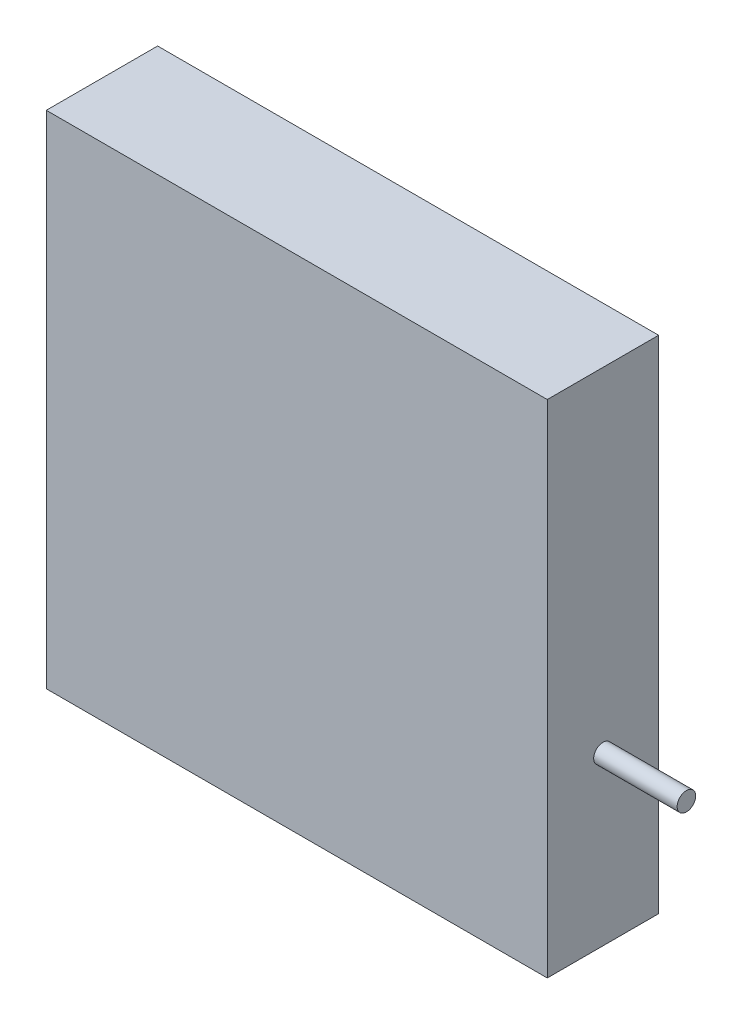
ISO-10303-21;
HEADER;
FILE_DESCRIPTION(('STEP AP214'),'2;1');
FILE_NAME('part.step','',(''),(''),'','','');
FILE_SCHEMA(('AUTOMOTIVE_DESIGN { 1 0 10303 214 1 1 1 1 }'));
ENDSEC;
DATA;
#1=APPLICATION_CONTEXT('core data for automotive mechanical design processes');
#2=APPLICATION_PROTOCOL_DEFINITION('international standard','automotive_design',2000,#1);
#3=PRODUCT_CONTEXT('',#1,'mechanical');
#4=PRODUCT('Part','Part','',(#3));
#5=PRODUCT_RELATED_PRODUCT_CATEGORY('part','',(#4));
#6=PRODUCT_DEFINITION_FORMATION('','',#4);
#7=PRODUCT_DEFINITION_CONTEXT('part definition',#1,'design');
#8=PRODUCT_DEFINITION('design','',#6,#7);
#9=PRODUCT_DEFINITION_SHAPE('','',#8);
#10=(LENGTH_UNIT() NAMED_UNIT(*) SI_UNIT(.MILLI.,.METRE.));
#11=(NAMED_UNIT(*) PLANE_ANGLE_UNIT() SI_UNIT($,.RADIAN.));
#12=(NAMED_UNIT(*) SI_UNIT($,.STERADIAN.) SOLID_ANGLE_UNIT());
#13=UNCERTAINTY_MEASURE_WITH_UNIT(LENGTH_MEASURE(1.E-05),#10,'distance_accuracy_value','');
#14=(GEOMETRIC_REPRESENTATION_CONTEXT(3) GLOBAL_UNCERTAINTY_ASSIGNED_CONTEXT((#13)) GLOBAL_UNIT_ASSIGNED_CONTEXT((#10,
#11,#12)) REPRESENTATION_CONTEXT('',''));
#15=CARTESIAN_POINT('',(0.,0.,0.));
#16=DIRECTION('',(0.,0.,1.));
#17=DIRECTION('',(1.,0.,0.));
#18=AXIS2_PLACEMENT_3D('',#15,#16,#17);
#19=CARTESIAN_POINT('',(0.,0.,-22.5));
#20=DIRECTION('',(0.,0.,1.));
#21=DIRECTION('',(1.,0.,0.));
#22=AXIS2_PLACEMENT_3D('',#19,#20,#21);
#23=PLANE('',#22);
#24=DIRECTION('',(0.,1.,0.));
#25=VECTOR('',#24,1.);
#26=CARTESIAN_POINT('',(-97.5,100.,-22.5));
#27=LINE('',#26,#25);
#28=CARTESIAN_POINT('',(-97.5,-100.,-22.5));
#29=VERTEX_POINT('',#28);
#30=CARTESIAN_POINT('',(-97.5,100.,-22.5));
#31=VERTEX_POINT('',#30);
#32=EDGE_CURVE('E224',#29,#31,#27,.T.);
#33=ORIENTED_EDGE('',*,*,#32,.F.);
#34=DIRECTION('',(-1.,0.,0.));
#35=VECTOR('',#34,1.);
#36=CARTESIAN_POINT('',(97.4999999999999,-100.,-22.5));
#37=LINE('',#36,#35);
#38=CARTESIAN_POINT('',(97.4999999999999,-100.,-22.5));
#39=VERTEX_POINT('',#38);
#40=EDGE_CURVE('E234',#39,#29,#37,.T.);
#41=ORIENTED_EDGE('',*,*,#40,.F.);
#42=DIRECTION('',(0.,-1.,0.));
#43=VECTOR('',#42,1.);
#44=CARTESIAN_POINT('',(97.5,100.,-22.5));
#45=LINE('',#44,#43);
#46=CARTESIAN_POINT('',(97.5,100.,-22.5));
#47=VERTEX_POINT('',#46);
#48=EDGE_CURVE('E231',#47,#39,#45,.T.);
#49=ORIENTED_EDGE('',*,*,#48,.F.);
#50=DIRECTION('',(1.,0.,0.));
#51=VECTOR('',#50,1.);
#52=CARTESIAN_POINT('',(97.5,100.,-22.5));
#53=LINE('',#52,#51);
#54=EDGE_CURVE('E227',#31,#47,#53,.T.);
#55=ORIENTED_EDGE('',*,*,#54,.F.);
#56=EDGE_LOOP('',(#33,#41,#49,#55));
#57=FACE_BOUND('',#56,.T.);
#58=DIRECTION('',(1.,0.,0.));
#59=VECTOR('',#58,1.);
#60=CARTESIAN_POINT('',(0.,114.,-22.5));
#61=LINE('',#60,#59);
#62=CARTESIAN_POINT('',(-111.5,114.,-22.5));
#63=VERTEX_POINT('',#62);
#64=CARTESIAN_POINT('',(111.5,114.,-22.5));
#65=VERTEX_POINT('',#64);
#66=EDGE_CURVE('E54',#63,#65,#61,.T.);
#67=ORIENTED_EDGE('',*,*,#66,.T.);
#68=DIRECTION('',(0.,-1.,0.));
#69=VECTOR('',#68,1.);
#70=CARTESIAN_POINT('',(111.5,0.,-22.5));
#71=LINE('',#70,#69);
#72=CARTESIAN_POINT('',(111.5,-114.,-22.5));
#73=VERTEX_POINT('',#72);
#74=EDGE_CURVE('E201',#65,#73,#71,.T.);
#75=ORIENTED_EDGE('',*,*,#74,.T.);
#76=DIRECTION('',(-1.,0.,0.));
#77=VECTOR('',#76,1.);
#78=CARTESIAN_POINT('',(0.,-114.,-22.5));
#79=LINE('',#78,#77);
#80=CARTESIAN_POINT('',(-111.5,-114.,-22.5));
#81=VERTEX_POINT('',#80);
#82=EDGE_CURVE('E198',#73,#81,#79,.T.);
#83=ORIENTED_EDGE('',*,*,#82,.T.);
#84=DIRECTION('',(0.,1.,0.));
#85=VECTOR('',#84,1.);
#86=CARTESIAN_POINT('',(-111.5,0.,-22.5));
#87=LINE('',#86,#85);
#88=EDGE_CURVE('E196',#81,#63,#87,.T.);
#89=ORIENTED_EDGE('',*,*,#88,.T.);
#90=EDGE_LOOP('',(#67,#75,#83,#89));
#91=FACE_BOUND('',#90,.T.);
#92=ADVANCED_FACE('F39',(#57,#91),#23,.F.);
#93=CARTESIAN_POINT('',(-97.5,100.,-22.5));
#94=DIRECTION('',(-1.,0.,0.));
#95=DIRECTION('',(0.,-1.,0.));
#96=AXIS2_PLACEMENT_3D('',#93,#94,#95);
#97=PLANE('',#96);
#98=DIRECTION('',(0.,1.,0.));
#99=VECTOR('',#98,1.);
#100=CARTESIAN_POINT('',(-97.5,100.,-37.5));
#101=LINE('',#100,#99);
#102=CARTESIAN_POINT('',(-97.5,-100.,-37.5));
#103=VERTEX_POINT('',#102);
#104=CARTESIAN_POINT('',(-97.5,100.,-37.5));
#105=VERTEX_POINT('',#104);
#106=EDGE_CURVE('E212',#103,#105,#101,.T.);
#107=ORIENTED_EDGE('',*,*,#106,.F.);
#108=DIRECTION('',(0.,0.,-1.));
#109=VECTOR('',#108,1.);
#110=CARTESIAN_POINT('',(-97.5,-100.,-22.5));
#111=LINE('',#110,#109);
#112=EDGE_CURVE('E248',#29,#103,#111,.T.);
#113=ORIENTED_EDGE('',*,*,#112,.F.);
#114=ORIENTED_EDGE('',*,*,#32,.T.);
#115=DIRECTION('',(0.,0.,-1.));
#116=VECTOR('',#115,1.);
#117=CARTESIAN_POINT('',(-97.5,100.,-22.5));
#118=LINE('',#117,#116);
#119=EDGE_CURVE('E237',#31,#105,#118,.T.);
#120=ORIENTED_EDGE('',*,*,#119,.T.);
#121=EDGE_LOOP('',(#107,#113,#114,#120));
#122=FACE_BOUND('',#121,.T.);
#123=ADVANCED_FACE('F316',(#122),#97,.T.);
#124=CARTESIAN_POINT('',(97.4999999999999,-100.,-22.5));
#125=DIRECTION('',(0.,-1.,0.));
#126=DIRECTION('',(0.,0.,-1.));
#127=AXIS2_PLACEMENT_3D('',#124,#125,#126);
#128=PLANE('',#127);
#129=DIRECTION('',(-1.,0.,0.));
#130=VECTOR('',#129,1.);
#131=CARTESIAN_POINT('',(97.4999999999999,-100.,-37.5));
#132=LINE('',#131,#130);
#133=CARTESIAN_POINT('',(97.4999999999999,-100.,-37.5));
#134=VERTEX_POINT('',#133);
#135=EDGE_CURVE('E228',#134,#103,#132,.T.);
#136=ORIENTED_EDGE('',*,*,#135,.F.);
#137=DIRECTION('',(0.,0.,-1.));
#138=VECTOR('',#137,1.);
#139=CARTESIAN_POINT('',(97.4999999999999,-100.,-22.5));
#140=LINE('',#139,#138);
#141=EDGE_CURVE('E251',#39,#134,#140,.T.);
#142=ORIENTED_EDGE('',*,*,#141,.F.);
#143=ORIENTED_EDGE('',*,*,#40,.T.);
#144=ORIENTED_EDGE('',*,*,#112,.T.);
#145=EDGE_LOOP('',(#136,#142,#143,#144));
#146=FACE_BOUND('',#145,.T.);
#147=ADVANCED_FACE('F321',(#146),#128,.T.);
#148=CARTESIAN_POINT('',(97.5,100.,-22.5));
#149=DIRECTION('',(1.,0.,0.));
#150=DIRECTION('',(0.,1.,0.));
#151=AXIS2_PLACEMENT_3D('',#148,#149,#150);
#152=PLANE('',#151);
#153=DIRECTION('',(0.,-1.,0.));
#154=VECTOR('',#153,1.);
#155=CARTESIAN_POINT('',(97.5,100.,-37.5));
#156=LINE('',#155,#154);
#157=CARTESIAN_POINT('',(97.5,100.,-37.5));
#158=VERTEX_POINT('',#157);
#159=EDGE_CURVE('E243',#158,#134,#156,.T.);
#160=ORIENTED_EDGE('',*,*,#159,.F.);
#161=DIRECTION('',(0.,0.,-1.));
#162=VECTOR('',#161,1.);
#163=CARTESIAN_POINT('',(97.5,100.,-22.5));
#164=LINE('',#163,#162);
#165=EDGE_CURVE('E253',#47,#158,#164,.T.);
#166=ORIENTED_EDGE('',*,*,#165,.F.);
#167=ORIENTED_EDGE('',*,*,#48,.T.);
#168=ORIENTED_EDGE('',*,*,#141,.T.);
#169=EDGE_LOOP('',(#160,#166,#167,#168));
#170=FACE_BOUND('',#169,.T.);
#171=ADVANCED_FACE('F375',(#170),#152,.T.);
#172=CARTESIAN_POINT('',(97.5,100.,-22.5));
#173=DIRECTION('',(0.,1.,0.));
#174=DIRECTION('',(0.,0.,1.));
#175=AXIS2_PLACEMENT_3D('',#172,#173,#174);
#176=PLANE('',#175);
#177=DIRECTION('',(1.,0.,0.));
#178=VECTOR('',#177,1.);
#179=CARTESIAN_POINT('',(97.5,100.,-37.5));
#180=LINE('',#179,#178);
#181=EDGE_CURVE('E240',#105,#158,#180,.T.);
#182=ORIENTED_EDGE('',*,*,#181,.F.);
#183=ORIENTED_EDGE('',*,*,#119,.F.);
#184=ORIENTED_EDGE('',*,*,#54,.T.);
#185=ORIENTED_EDGE('',*,*,#165,.T.);
#186=EDGE_LOOP('',(#182,#183,#184,#185));
#187=FACE_BOUND('',#186,.T.);
#188=ADVANCED_FACE('F379',(#187),#176,.T.);
#189=CARTESIAN_POINT('',(0.,0.,-37.5));
#190=DIRECTION('',(0.,0.,1.));
#191=DIRECTION('',(1.,0.,0.));
#192=AXIS2_PLACEMENT_3D('',#189,#190,#191);
#193=PLANE('',#192);
#194=ORIENTED_EDGE('',*,*,#106,.T.);
#195=ORIENTED_EDGE('',*,*,#181,.T.);
#196=ORIENTED_EDGE('',*,*,#159,.T.);
#197=ORIENTED_EDGE('',*,*,#135,.T.);
#198=EDGE_LOOP('',(#194,#195,#196,#197));
#199=FACE_BOUND('',#198,.T.);
#200=ADVANCED_FACE('F363',(#199),#193,.F.);
#201=CARTESIAN_POINT('',(0.,-125.,-14.5));
#202=DIRECTION('',(0.,-1.,0.));
#203=DIRECTION('',(0.,0.,-1.));
#204=AXIS2_PLACEMENT_3D('',#201,#202,#203);
#205=PLANE('',#204);
#206=DIRECTION('',(-1.,0.,0.));
#207=VECTOR('',#206,1.);
#208=CARTESIAN_POINT('',(0.,-125.,-22.5));
#209=LINE('',#208,#207);
#210=CARTESIAN_POINT('',(125.,-125.,-22.5));
#211=VERTEX_POINT('',#210);
#212=CARTESIAN_POINT('',(-125.,-125.,-22.5));
#213=VERTEX_POINT('',#212);
#214=EDGE_CURVE('E62',#211,#213,#209,.T.);
#215=ORIENTED_EDGE('',*,*,#214,.T.);
#216=DIRECTION('',(0.,0.,-1.));
#217=VECTOR('',#216,1.);
#218=CARTESIAN_POINT('',(-125.,-125.,-14.5));
#219=LINE('',#218,#217);
#220=CARTESIAN_POINT('',(-125.,-125.,-14.5));
#221=VERTEX_POINT('',#220);
#222=EDGE_CURVE('E217',#221,#213,#219,.T.);
#223=ORIENTED_EDGE('',*,*,#222,.F.);
#224=DIRECTION('',(-1.,0.,0.));
#225=VECTOR('',#224,1.);
#226=CARTESIAN_POINT('',(0.,-125.,-14.5));
#227=LINE('',#226,#225);
#228=CARTESIAN_POINT('',(125.,-125.,-14.5));
#229=VERTEX_POINT('',#228);
#230=EDGE_CURVE('E184',#229,#221,#227,.T.);
#231=ORIENTED_EDGE('',*,*,#230,.F.);
#232=DIRECTION('',(0.,0.,-1.));
#233=VECTOR('',#232,1.);
#234=CARTESIAN_POINT('',(125.,-125.,-14.5));
#235=LINE('',#234,#233);
#236=EDGE_CURVE('E210',#229,#211,#235,.T.);
#237=ORIENTED_EDGE('',*,*,#236,.T.);
#238=EDGE_LOOP('',(#215,#223,#231,#237));
#239=FACE_BOUND('',#238,.T.);
#240=ADVANCED_FACE('F343',(#239),#205,.F.);
#241=CARTESIAN_POINT('',(125.,0.,-14.5));
#242=DIRECTION('',(1.,0.,0.));
#243=DIRECTION('',(0.,0.,-1.));
#244=AXIS2_PLACEMENT_3D('',#241,#242,#243);
#245=PLANE('',#244);
#246=DIRECTION('',(0.,-1.,0.));
#247=VECTOR('',#246,1.);
#248=CARTESIAN_POINT('',(125.,0.,-22.5));
#249=LINE('',#248,#247);
#250=CARTESIAN_POINT('',(125.,125.,-22.5));
#251=VERTEX_POINT('',#250);
#252=EDGE_CURVE('E174',#251,#211,#249,.T.);
#253=ORIENTED_EDGE('',*,*,#252,.T.);
#254=ORIENTED_EDGE('',*,*,#236,.F.);
#255=DIRECTION('',(0.,-1.,0.));
#256=VECTOR('',#255,1.);
#257=CARTESIAN_POINT('',(125.,0.,-14.5));
#258=LINE('',#257,#256);
#259=CARTESIAN_POINT('',(125.,125.,-14.5));
#260=VERTEX_POINT('',#259);
#261=EDGE_CURVE('E169',#260,#229,#258,.T.);
#262=ORIENTED_EDGE('',*,*,#261,.F.);
#263=DIRECTION('',(0.,0.,-1.));
#264=VECTOR('',#263,1.);
#265=CARTESIAN_POINT('',(125.,125.,-14.5));
#266=LINE('',#265,#264);
#267=EDGE_CURVE('E213',#260,#251,#266,.T.);
#268=ORIENTED_EDGE('',*,*,#267,.T.);
#269=EDGE_LOOP('',(#253,#254,#262,#268));
#270=FACE_BOUND('',#269,.T.);
#271=ADVANCED_FACE('F346',(#270),#245,.F.);
#272=CARTESIAN_POINT('',(0.,125.,-14.5));
#273=DIRECTION('',(0.,1.,0.));
#274=DIRECTION('',(0.,0.,1.));
#275=AXIS2_PLACEMENT_3D('',#272,#273,#274);
#276=PLANE('',#275);
#277=DIRECTION('',(1.,0.,0.));
#278=VECTOR('',#277,1.);
#279=CARTESIAN_POINT('',(0.,125.,-22.5));
#280=LINE('',#279,#278);
#281=CARTESIAN_POINT('',(-125.,125.,-22.5));
#282=VERTEX_POINT('',#281);
#283=EDGE_CURVE('E177',#282,#251,#280,.T.);
#284=ORIENTED_EDGE('',*,*,#283,.T.);
#285=ORIENTED_EDGE('',*,*,#267,.F.);
#286=DIRECTION('',(1.,0.,0.));
#287=VECTOR('',#286,1.);
#288=CARTESIAN_POINT('',(0.,125.,-14.5));
#289=LINE('',#288,#287);
#290=CARTESIAN_POINT('',(-125.,125.,-14.5));
#291=VERTEX_POINT('',#290);
#292=EDGE_CURVE('E190',#291,#260,#289,.T.);
#293=ORIENTED_EDGE('',*,*,#292,.F.);
#294=DIRECTION('',(0.,0.,-1.));
#295=VECTOR('',#294,1.);
#296=CARTESIAN_POINT('',(-125.,125.,-14.5));
#297=LINE('',#296,#295);
#298=EDGE_CURVE('E215',#291,#282,#297,.T.);
#299=ORIENTED_EDGE('',*,*,#298,.T.);
#300=EDGE_LOOP('',(#284,#285,#293,#299));
#301=FACE_BOUND('',#300,.T.);
#302=ADVANCED_FACE('F348',(#301),#276,.F.);
#303=CARTESIAN_POINT('',(0.,114.,-14.5));
#304=DIRECTION('',(0.,1.,0.));
#305=DIRECTION('',(0.,0.,1.));
#306=AXIS2_PLACEMENT_3D('',#303,#304,#305);
#307=PLANE('',#306);
#308=ORIENTED_EDGE('',*,*,#66,.F.);
#309=DIRECTION('',(0.,0.,-1.));
#310=VECTOR('',#309,1.);
#311=CARTESIAN_POINT('',(-111.5,114.,-14.5));
#312=LINE('',#311,#310);
#313=CARTESIAN_POINT('',(-111.5,114.,-14.5));
#314=VERTEX_POINT('',#313);
#315=EDGE_CURVE('E157',#314,#63,#312,.T.);
#316=ORIENTED_EDGE('',*,*,#315,.F.);
#317=DIRECTION('',(1.,0.,0.));
#318=VECTOR('',#317,1.);
#319=CARTESIAN_POINT('',(0.,114.,-14.5));
#320=LINE('',#319,#318);
#321=CARTESIAN_POINT('',(111.5,114.,-14.5));
#322=VERTEX_POINT('',#321);
#323=EDGE_CURVE('E164',#314,#322,#320,.T.);
#324=ORIENTED_EDGE('',*,*,#323,.T.);
#325=DIRECTION('',(0.,0.,-1.));
#326=VECTOR('',#325,1.);
#327=CARTESIAN_POINT('',(111.5,114.,-14.5));
#328=LINE('',#327,#326);
#329=EDGE_CURVE('E219',#322,#65,#328,.T.);
#330=ORIENTED_EDGE('',*,*,#329,.T.);
#331=EDGE_LOOP('',(#308,#316,#324,#330));
#332=FACE_BOUND('',#331,.T.);
#333=ADVANCED_FACE('F167',(#332),#307,.T.);
#334=CARTESIAN_POINT('',(111.5,0.,-14.5));
#335=DIRECTION('',(1.,0.,0.));
#336=DIRECTION('',(0.,0.,-1.));
#337=AXIS2_PLACEMENT_3D('',#334,#335,#336);
#338=PLANE('',#337);
#339=ORIENTED_EDGE('',*,*,#74,.F.);
#340=ORIENTED_EDGE('',*,*,#329,.F.);
#341=DIRECTION('',(0.,-1.,0.));
#342=VECTOR('',#341,1.);
#343=CARTESIAN_POINT('',(111.5,0.,-14.5));
#344=LINE('',#343,#342);
#345=CARTESIAN_POINT('',(111.5,-114.,-14.5));
#346=VERTEX_POINT('',#345);
#347=EDGE_CURVE('E173',#322,#346,#344,.T.);
#348=ORIENTED_EDGE('',*,*,#347,.T.);
#349=DIRECTION('',(0.,0.,-1.));
#350=VECTOR('',#349,1.);
#351=CARTESIAN_POINT('',(111.5,-114.,-14.5));
#352=LINE('',#351,#350);
#353=EDGE_CURVE('E221',#346,#73,#352,.T.);
#354=ORIENTED_EDGE('',*,*,#353,.T.);
#355=EDGE_LOOP('',(#339,#340,#348,#354));
#356=FACE_BOUND('',#355,.T.);
#357=ADVANCED_FACE('F355',(#356),#338,.T.);
#358=CARTESIAN_POINT('',(0.,-114.,-14.5));
#359=DIRECTION('',(0.,-1.,0.));
#360=DIRECTION('',(0.,0.,-1.));
#361=AXIS2_PLACEMENT_3D('',#358,#359,#360);
#362=PLANE('',#361);
#363=ORIENTED_EDGE('',*,*,#82,.F.);
#364=ORIENTED_EDGE('',*,*,#353,.F.);
#365=DIRECTION('',(-1.,0.,0.));
#366=VECTOR('',#365,1.);
#367=CARTESIAN_POINT('',(0.,-114.,-14.5));
#368=LINE('',#367,#366);
#369=CARTESIAN_POINT('',(-111.5,-114.,-14.5));
#370=VERTEX_POINT('',#369);
#371=EDGE_CURVE('E163',#346,#370,#368,.T.);
#372=ORIENTED_EDGE('',*,*,#371,.T.);
#373=DIRECTION('',(0.,0.,-1.));
#374=VECTOR('',#373,1.);
#375=CARTESIAN_POINT('',(-111.5,-114.,-14.5));
#376=LINE('',#375,#374);
#377=EDGE_CURVE('E159',#370,#81,#376,.T.);
#378=ORIENTED_EDGE('',*,*,#377,.T.);
#379=EDGE_LOOP('',(#363,#364,#372,#378));
#380=FACE_BOUND('',#379,.T.);
#381=ADVANCED_FACE('F366',(#380),#362,.T.);
#382=CARTESIAN_POINT('',(-111.5,0.,-14.5));
#383=DIRECTION('',(-1.,0.,0.));
#384=DIRECTION('',(0.,0.,1.));
#385=AXIS2_PLACEMENT_3D('',#382,#383,#384);
#386=PLANE('',#385);
#387=ORIENTED_EDGE('',*,*,#88,.F.);
#388=ORIENTED_EDGE('',*,*,#377,.F.);
#389=DIRECTION('',(0.,1.,0.));
#390=VECTOR('',#389,1.);
#391=CARTESIAN_POINT('',(-111.5,0.,-14.5));
#392=LINE('',#391,#390);
#393=EDGE_CURVE('E154',#370,#314,#392,.T.);
#394=ORIENTED_EDGE('',*,*,#393,.T.);
#395=ORIENTED_EDGE('',*,*,#315,.T.);
#396=EDGE_LOOP('',(#387,#388,#394,#395));
#397=FACE_BOUND('',#396,.T.);
#398=ADVANCED_FACE('F156',(#397),#386,.T.);
#399=CARTESIAN_POINT('',(-125.,0.,-14.5));
#400=DIRECTION('',(-1.,0.,0.));
#401=DIRECTION('',(0.,0.,1.));
#402=AXIS2_PLACEMENT_3D('',#399,#400,#401);
#403=PLANE('',#402);
#404=DIRECTION('',(0.,1.,0.));
#405=VECTOR('',#404,1.);
#406=CARTESIAN_POINT('',(-125.,0.,-22.5));
#407=LINE('',#406,#405);
#408=EDGE_CURVE('E205',#213,#282,#407,.T.);
#409=ORIENTED_EDGE('',*,*,#408,.T.);
#410=ORIENTED_EDGE('',*,*,#298,.F.);
#411=DIRECTION('',(0.,1.,0.));
#412=VECTOR('',#411,1.);
#413=CARTESIAN_POINT('',(-125.,0.,-14.5));
#414=LINE('',#413,#412);
#415=EDGE_CURVE('E187',#221,#291,#414,.T.);
#416=ORIENTED_EDGE('',*,*,#415,.F.);
#417=ORIENTED_EDGE('',*,*,#222,.T.);
#418=EDGE_LOOP('',(#409,#410,#416,#417));
#419=FACE_BOUND('',#418,.T.);
#420=ADVANCED_FACE('F311',(#419),#403,.F.);
#421=CARTESIAN_POINT('',(0.,0.,-14.5));
#422=DIRECTION('',(0.,0.,-1.));
#423=DIRECTION('',(-1.,0.,0.));
#424=AXIS2_PLACEMENT_3D('',#421,#422,#423);
#425=PLANE('',#424);
#426=ORIENTED_EDGE('',*,*,#323,.F.);
#427=ORIENTED_EDGE('',*,*,#393,.F.);
#428=ORIENTED_EDGE('',*,*,#371,.F.);
#429=ORIENTED_EDGE('',*,*,#347,.F.);
#430=EDGE_LOOP('',(#426,#427,#428,#429));
#431=FACE_BOUND('',#430,.T.);
#432=ORIENTED_EDGE('',*,*,#230,.T.);
#433=ORIENTED_EDGE('',*,*,#415,.T.);
#434=ORIENTED_EDGE('',*,*,#292,.T.);
#435=ORIENTED_EDGE('',*,*,#261,.T.);
#436=EDGE_LOOP('',(#432,#433,#434,#435));
#437=FACE_BOUND('',#436,.T.);
#438=ADVANCED_FACE('F171',(#431,#437),#425,.T.);
#439=CARTESIAN_POINT('',(0.,0.,37.5));
#440=DIRECTION('',(0.,0.,1.));
#441=DIRECTION('',(1.,0.,0.));
#442=AXIS2_PLACEMENT_3D('',#439,#440,#441);
#443=PLANE('',#442);
#444=DIRECTION('',(0.,1.,0.));
#445=VECTOR('',#444,1.);
#446=CARTESIAN_POINT('',(135.,135.,37.5));
#447=LINE('',#446,#445);
#448=CARTESIAN_POINT('',(135.,-135.,37.5));
#449=VERTEX_POINT('',#448);
#450=CARTESIAN_POINT('',(135.,135.,37.5));
#451=VERTEX_POINT('',#450);
#452=EDGE_CURVE('E264',#449,#451,#447,.T.);
#453=ORIENTED_EDGE('',*,*,#452,.T.);
#454=DIRECTION('',(-1.,0.,0.));
#455=VECTOR('',#454,1.);
#456=CARTESIAN_POINT('',(-135.,135.,37.5));
#457=LINE('',#456,#455);
#458=CARTESIAN_POINT('',(-135.,135.,37.5));
#459=VERTEX_POINT('',#458);
#460=EDGE_CURVE('E267',#451,#459,#457,.T.);
#461=ORIENTED_EDGE('',*,*,#460,.T.);
#462=DIRECTION('',(0.,-1.,0.));
#463=VECTOR('',#462,1.);
#464=CARTESIAN_POINT('',(-135.,135.,37.5));
#465=LINE('',#464,#463);
#466=CARTESIAN_POINT('',(-135.,-135.,37.5));
#467=VERTEX_POINT('',#466);
#468=EDGE_CURVE('E269',#459,#467,#465,.T.);
#469=ORIENTED_EDGE('',*,*,#468,.T.);
#470=DIRECTION('',(1.,0.,0.));
#471=VECTOR('',#470,1.);
#472=CARTESIAN_POINT('',(-135.,-135.,37.5));
#473=LINE('',#472,#471);
#474=EDGE_CURVE('E271',#467,#449,#473,.T.);
#475=ORIENTED_EDGE('',*,*,#474,.T.);
#476=EDGE_LOOP('',(#453,#461,#469,#475));
#477=FACE_BOUND('',#476,.T.);
#478=ADVANCED_FACE('F303',(#477),#443,.T.);
#479=CARTESIAN_POINT('',(-135.,135.,37.5));
#480=DIRECTION('',(1.,0.,0.));
#481=DIRECTION('',(0.,0.,-1.));
#482=AXIS2_PLACEMENT_3D('',#479,#480,#481);
#483=PLANE('',#482);
#484=DIRECTION('',(0.,0.,-1.));
#485=VECTOR('',#484,1.);
#486=CARTESIAN_POINT('',(-135.,135.,37.5));
#487=LINE('',#486,#485);
#488=CARTESIAN_POINT('',(-135.,135.,-22.5));
#489=VERTEX_POINT('',#488);
#490=EDGE_CURVE('E279',#459,#489,#487,.T.);
#491=ORIENTED_EDGE('',*,*,#490,.T.);
#492=DIRECTION('',(0.,1.,0.));
#493=VECTOR('',#492,1.);
#494=CARTESIAN_POINT('',(-135.,135.,-22.5));
#495=LINE('',#494,#493);
#496=CARTESIAN_POINT('',(-135.,-135.,-22.5));
#497=VERTEX_POINT('',#496);
#498=EDGE_CURVE('E262',#497,#489,#495,.T.);
#499=ORIENTED_EDGE('',*,*,#498,.F.);
#500=DIRECTION('',(0.,0.,-1.));
#501=VECTOR('',#500,1.);
#502=CARTESIAN_POINT('',(-135.,-135.,37.5));
#503=LINE('',#502,#501);
#504=EDGE_CURVE('E276',#467,#497,#503,.T.);
#505=ORIENTED_EDGE('',*,*,#504,.F.);
#506=ORIENTED_EDGE('',*,*,#468,.F.);
#507=EDGE_LOOP('',(#491,#499,#505,#506));
#508=FACE_BOUND('',#507,.T.);
#509=ADVANCED_FACE('F301',(#508),#483,.F.);
#510=CARTESIAN_POINT('',(-135.,-135.,37.5));
#511=DIRECTION('',(0.,1.,0.));
#512=DIRECTION('',(0.,0.,1.));
#513=AXIS2_PLACEMENT_3D('',#510,#511,#512);
#514=PLANE('',#513);
#515=ORIENTED_EDGE('',*,*,#504,.T.);
#516=DIRECTION('',(-1.,0.,0.));
#517=VECTOR('',#516,1.);
#518=CARTESIAN_POINT('',(-135.,-135.,-22.5));
#519=LINE('',#518,#517);
#520=CARTESIAN_POINT('',(135.,-135.,-22.5));
#521=VERTEX_POINT('',#520);
#522=EDGE_CURVE('E260',#521,#497,#519,.T.);
#523=ORIENTED_EDGE('',*,*,#522,.F.);
#524=DIRECTION('',(0.,0.,-1.));
#525=VECTOR('',#524,1.);
#526=CARTESIAN_POINT('',(135.,-135.,37.5));
#527=LINE('',#526,#525);
#528=EDGE_CURVE('E273',#449,#521,#527,.T.);
#529=ORIENTED_EDGE('',*,*,#528,.F.);
#530=ORIENTED_EDGE('',*,*,#474,.F.);
#531=EDGE_LOOP('',(#515,#523,#529,#530));
#532=FACE_BOUND('',#531,.T.);
#533=ADVANCED_FACE('F296',(#532),#514,.F.);
#534=CARTESIAN_POINT('',(135.,135.,37.5));
#535=DIRECTION('',(-1.,0.,0.));
#536=DIRECTION('',(0.,-1.,0.));
#537=AXIS2_PLACEMENT_3D('',#534,#535,#536);
#538=PLANE('',#537);
#539=CARTESIAN_POINT('',(135.,-45.,7.5));
#540=DIRECTION('',(-1.,0.,0.));
#541=DIRECTION('',(0.,-1.,0.));
#542=AXIS2_PLACEMENT_3D('',#539,#540,#541);
#543=CIRCLE('',#542,5.);
#544=CARTESIAN_POINT('',(135.,-50.,7.5));
#545=VERTEX_POINT('',#544);
#546=EDGE_CURVE('E11',#545,#545,#543,.F.);
#547=ORIENTED_EDGE('',*,*,#546,.F.);
#548=EDGE_LOOP('',(#547));
#549=FACE_BOUND('',#548,.T.);
#550=ORIENTED_EDGE('',*,*,#528,.T.);
#551=DIRECTION('',(0.,-1.,0.));
#552=VECTOR('',#551,1.);
#553=CARTESIAN_POINT('',(135.,-135.,-22.5));
#554=LINE('',#553,#552);
#555=CARTESIAN_POINT('',(135.,135.,-22.5));
#556=VERTEX_POINT('',#555);
#557=EDGE_CURVE('E258',#556,#521,#554,.T.);
#558=ORIENTED_EDGE('',*,*,#557,.F.);
#559=DIRECTION('',(0.,0.,-1.));
#560=VECTOR('',#559,1.);
#561=CARTESIAN_POINT('',(135.,135.,37.5));
#562=LINE('',#561,#560);
#563=EDGE_CURVE('E47',#451,#556,#562,.T.);
#564=ORIENTED_EDGE('',*,*,#563,.F.);
#565=ORIENTED_EDGE('',*,*,#452,.F.);
#566=EDGE_LOOP('',(#550,#558,#564,#565));
#567=FACE_BOUND('',#566,.T.);
#568=ADVANCED_FACE('F41',(#549,#567),#538,.F.);
#569=CARTESIAN_POINT('',(-135.,135.,37.5));
#570=DIRECTION('',(0.,-1.,0.));
#571=DIRECTION('',(0.,0.,-1.));
#572=AXIS2_PLACEMENT_3D('',#569,#570,#571);
#573=PLANE('',#572);
#574=ORIENTED_EDGE('',*,*,#563,.T.);
#575=DIRECTION('',(1.,0.,0.));
#576=VECTOR('',#575,1.);
#577=CARTESIAN_POINT('',(135.,135.,-22.5));
#578=LINE('',#577,#576);
#579=EDGE_CURVE('E250',#489,#556,#578,.T.);
#580=ORIENTED_EDGE('',*,*,#579,.F.);
#581=ORIENTED_EDGE('',*,*,#490,.F.);
#582=ORIENTED_EDGE('',*,*,#460,.F.);
#583=EDGE_LOOP('',(#574,#580,#581,#582));
#584=FACE_BOUND('',#583,.T.);
#585=ADVANCED_FACE('F285',(#584),#573,.F.);
#586=ORIENTED_EDGE('',*,*,#408,.F.);
#587=ORIENTED_EDGE('',*,*,#214,.F.);
#588=ORIENTED_EDGE('',*,*,#252,.F.);
#589=ORIENTED_EDGE('',*,*,#283,.F.);
#590=EDGE_LOOP('',(#586,#587,#588,#589));
#591=FACE_BOUND('',#590,.T.);
#592=ORIENTED_EDGE('',*,*,#579,.T.);
#593=ORIENTED_EDGE('',*,*,#557,.T.);
#594=ORIENTED_EDGE('',*,*,#522,.T.);
#595=ORIENTED_EDGE('',*,*,#498,.T.);
#596=EDGE_LOOP('',(#592,#593,#594,#595));
#597=FACE_BOUND('',#596,.T.);
#598=ADVANCED_FACE('F293',(#591,#597),#23,.F.);
#599=CARTESIAN_POINT('',(180.,-45.,7.5));
#600=DIRECTION('',(-1.,0.,0.));
#601=DIRECTION('',(0.,-1.,0.));
#602=AXIS2_PLACEMENT_3D('',#599,#600,#601);
#603=CYLINDRICAL_SURFACE('',#602,5.);
#604=CARTESIAN_POINT('',(180.,-45.,7.5));
#605=DIRECTION('',(1.,0.,0.));
#606=DIRECTION('',(0.,1.,0.));
#607=AXIS2_PLACEMENT_3D('',#604,#605,#606);
#608=CIRCLE('',#607,5.);
#609=CARTESIAN_POINT('',(180.,-50.,7.5));
#610=VERTEX_POINT('',#609);
#611=EDGE_CURVE('E180',#610,#610,#608,.T.);
#612=CARTESIAN_POINT('',(180.,-50.,7.5));
#613=CARTESIAN_POINT('',(179.53125,-50.,7.5));
#614=CARTESIAN_POINT('',(179.0625,-50.,7.5));
#615=CARTESIAN_POINT('',(178.125,-50.,7.5));
#616=CARTESIAN_POINT('',(177.65625,-50.,7.5));
#617=CARTESIAN_POINT('',(176.71875,-50.,7.5));
#618=CARTESIAN_POINT('',(176.25,-50.,7.5));
#619=CARTESIAN_POINT('',(175.3125,-50.,7.5));
#620=CARTESIAN_POINT('',(174.84375,-50.,7.5));
#621=CARTESIAN_POINT('',(173.90625,-50.,7.5));
#622=CARTESIAN_POINT('',(173.4375,-50.,7.5));
#623=CARTESIAN_POINT('',(172.5,-50.,7.5));
#624=CARTESIAN_POINT('',(172.03125,-50.,7.5));
#625=CARTESIAN_POINT('',(171.09375,-50.,7.5));
#626=CARTESIAN_POINT('',(170.625,-50.,7.5));
#627=CARTESIAN_POINT('',(169.6875,-50.,7.5));
#628=CARTESIAN_POINT('',(169.21875,-50.,7.5));
#629=CARTESIAN_POINT('',(168.28125,-50.,7.5));
#630=CARTESIAN_POINT('',(167.8125,-50.,7.5));
#631=CARTESIAN_POINT('',(166.875,-50.,7.5));
#632=CARTESIAN_POINT('',(166.40625,-50.,7.5));
#633=CARTESIAN_POINT('',(165.46875,-50.,7.5));
#634=CARTESIAN_POINT('',(165.,-50.,7.5));
#635=CARTESIAN_POINT('',(164.0625,-50.,7.5));
#636=CARTESIAN_POINT('',(163.59375,-50.,7.5));
#637=CARTESIAN_POINT('',(162.65625,-50.,7.5));
#638=CARTESIAN_POINT('',(162.1875,-50.,7.5));
#639=CARTESIAN_POINT('',(161.25,-50.,7.5));
#640=CARTESIAN_POINT('',(160.78125,-50.,7.5));
#641=CARTESIAN_POINT('',(159.84375,-50.,7.5));
#642=CARTESIAN_POINT('',(159.375,-50.,7.5));
#643=CARTESIAN_POINT('',(158.4375,-50.,7.5));
#644=CARTESIAN_POINT('',(157.96875,-50.,7.5));
#645=CARTESIAN_POINT('',(157.03125,-50.,7.5));
#646=CARTESIAN_POINT('',(156.5625,-50.,7.5));
#647=CARTESIAN_POINT('',(155.625,-50.,7.5));
#648=CARTESIAN_POINT('',(155.15625,-50.,7.5));
#649=CARTESIAN_POINT('',(154.21875,-50.,7.5));
#650=CARTESIAN_POINT('',(153.75,-50.,7.5));
#651=CARTESIAN_POINT('',(152.8125,-50.,7.5));
#652=CARTESIAN_POINT('',(152.34375,-50.,7.5));
#653=CARTESIAN_POINT('',(151.40625,-50.,7.5));
#654=CARTESIAN_POINT('',(150.9375,-50.,7.5));
#655=CARTESIAN_POINT('',(150.,-50.,7.5));
#656=CARTESIAN_POINT('',(149.53125,-50.,7.5));
#657=CARTESIAN_POINT('',(148.59375,-50.,7.5));
#658=CARTESIAN_POINT('',(148.125,-50.,7.5));
#659=CARTESIAN_POINT('',(147.1875,-50.,7.5));
#660=CARTESIAN_POINT('',(146.71875,-50.,7.5));
#661=CARTESIAN_POINT('',(145.78125,-50.,7.5));
#662=CARTESIAN_POINT('',(145.3125,-50.,7.5));
#663=CARTESIAN_POINT('',(144.375,-50.,7.5));
#664=CARTESIAN_POINT('',(143.90625,-50.,7.5));
#665=CARTESIAN_POINT('',(142.96875,-50.,7.5));
#666=CARTESIAN_POINT('',(142.5,-50.,7.5));
#667=CARTESIAN_POINT('',(141.5625,-50.,7.5));
#668=CARTESIAN_POINT('',(141.09375,-50.,7.5));
#669=CARTESIAN_POINT('',(140.15625,-50.,7.5));
#670=CARTESIAN_POINT('',(139.6875,-50.,7.5));
#671=CARTESIAN_POINT('',(138.75,-50.,7.5));
#672=CARTESIAN_POINT('',(138.28125,-50.,7.5));
#673=CARTESIAN_POINT('',(137.34375,-50.,7.5));
#674=CARTESIAN_POINT('',(136.875,-50.,7.5));
#675=CARTESIAN_POINT('',(135.9375,-50.,7.5));
#676=CARTESIAN_POINT('',(135.46875,-50.,7.5));
#677=CARTESIAN_POINT('',(135.,-50.,7.5));
#678=B_SPLINE_CURVE_WITH_KNOTS('',3,(#612,#613,#614,#615,#616,#617,#618,#619,#620,#621,#622,
#623,#624,#625,#626,#627,#628,#629,#630,#631,#632,#633,#634,#635,#636,#637,#638,#639,#640,#641,
#642,#643,#644,#645,#646,#647,#648,#649,#650,#651,#652,#653,#654,#655,#656,#657,#658,#659,#660,
#661,#662,#663,#664,#665,#666,#667,#668,#669,#670,#671,#672,#673,#674,#675,#676,#677),
.UNSPECIFIED.,.F.,.F.,(4,2,2,2,2,2,2,2,2,2,2,2,2,2,2,2,2,2,2,2,2,2,2,2,2,2,2,2,2,2,2,2,4),(0.,
1.40625000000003,2.81250000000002,4.21875000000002,5.62500000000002,7.03125000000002,
8.43750000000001,9.84375000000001,11.25,12.65625,14.0625,15.46875,16.875,18.28125,19.6875,
21.09375,22.5,23.90625,25.3125,26.71875,28.125,29.53125,30.9375,32.34375,33.75,35.15625,36.5625,
37.96875,39.375,40.78125,42.1875,43.59375,45.),.UNSPECIFIED.);
#679=EDGE_CURVE('BSEAM327',#610,#545,#678,.T.);
#680=ORIENTED_EDGE('',*,*,#611,.F.);
#681=ORIENTED_EDGE('',*,*,#546,.T.);
#682=ORIENTED_EDGE('',*,*,#679,.T.);
#683=ORIENTED_EDGE('',*,*,#679,.F.);
#684=EDGE_LOOP('',(#680,#682,#681,#683));
#685=FACE_BOUND('',#684,.T.);
#686=ADVANCED_FACE('F327',(#685),#603,.T.);
#687=CARTESIAN_POINT('',(180.,-45.,7.5));
#688=DIRECTION('',(1.,0.,0.));
#689=DIRECTION('',(0.,1.,0.));
#690=AXIS2_PLACEMENT_3D('',#687,#688,#689);
#691=PLANE('',#690);
#692=ORIENTED_EDGE('',*,*,#611,.T.);
#693=EDGE_LOOP('',(#692));
#694=FACE_BOUND('',#693,.T.);
#695=ADVANCED_FACE('F333',(#694),#691,.T.);
#696=CLOSED_SHELL('',(#92,#123,#147,#171,#188,#200,#240,#271,#302,#333,#357,#381,#398,#420,#438,
#478,#509,#533,#568,#585,#598,#686,#695));
#697=MANIFOLD_SOLID_BREP('B2',#696);
#698=ADVANCED_BREP_SHAPE_REPRESENTATION('',(#18,#697),#14);
#699=SHAPE_DEFINITION_REPRESENTATION(#9,#698);
ENDSEC;
END-ISO-10303-21;
